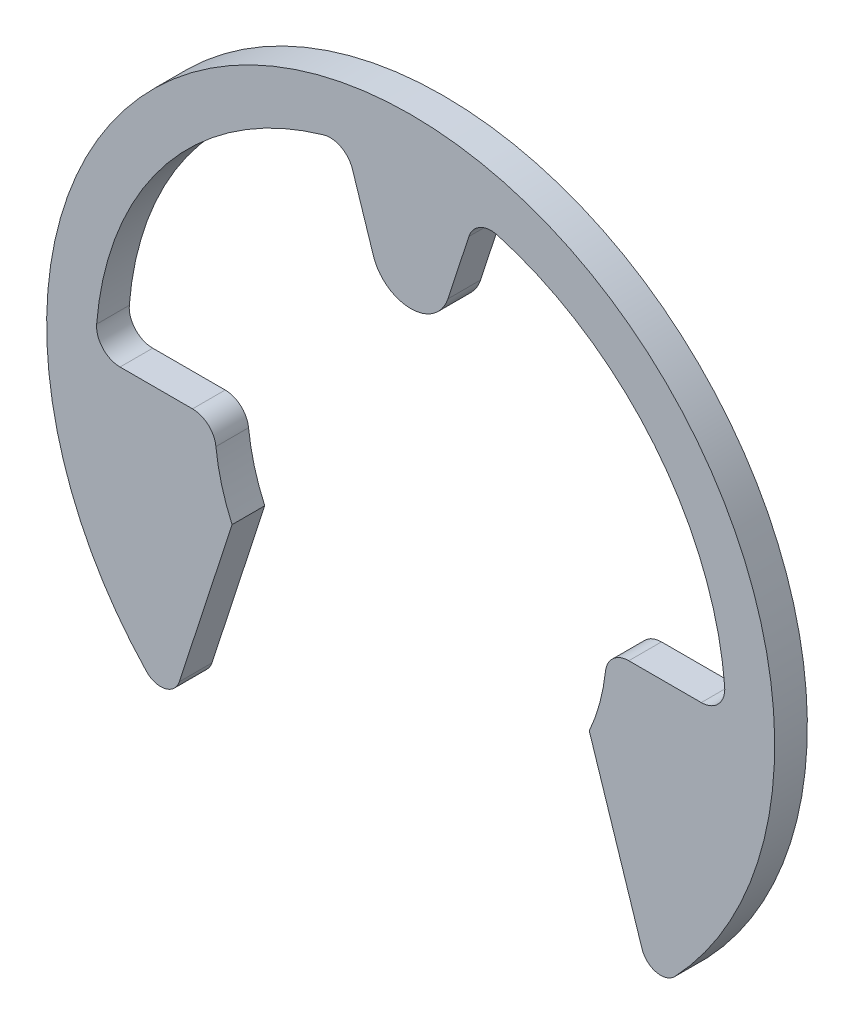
ISO-10303-21;
HEADER;
FILE_DESCRIPTION(('STEP AP214'),'2;1');
FILE_NAME('part.step','',(''),(''),'','','');
FILE_SCHEMA(('AUTOMOTIVE_DESIGN { 1 0 10303 214 1 1 1 1 }'));
ENDSEC;
DATA;
#1=APPLICATION_CONTEXT('core data for automotive mechanical design processes');
#2=APPLICATION_PROTOCOL_DEFINITION('international standard','automotive_design',2000,#1);
#3=PRODUCT_CONTEXT('',#1,'mechanical');
#4=PRODUCT('Part','Part','',(#3));
#5=PRODUCT_RELATED_PRODUCT_CATEGORY('part','',(#4));
#6=PRODUCT_DEFINITION_FORMATION('','',#4);
#7=PRODUCT_DEFINITION_CONTEXT('part definition',#1,'design');
#8=PRODUCT_DEFINITION('design','',#6,#7);
#9=PRODUCT_DEFINITION_SHAPE('','',#8);
#10=(LENGTH_UNIT() NAMED_UNIT(*) SI_UNIT(.MILLI.,.METRE.));
#11=(NAMED_UNIT(*) PLANE_ANGLE_UNIT() SI_UNIT($,.RADIAN.));
#12=(NAMED_UNIT(*) SI_UNIT($,.STERADIAN.) SOLID_ANGLE_UNIT());
#13=UNCERTAINTY_MEASURE_WITH_UNIT(LENGTH_MEASURE(1.E-05),#10,'distance_accuracy_value','');
#14=(GEOMETRIC_REPRESENTATION_CONTEXT(3) GLOBAL_UNCERTAINTY_ASSIGNED_CONTEXT((#13)) GLOBAL_UNIT_ASSIGNED_CONTEXT((#10,
#11,#12)) REPRESENTATION_CONTEXT('',''));
#15=CARTESIAN_POINT('',(0.,0.,0.));
#16=DIRECTION('',(0.,0.,1.));
#17=DIRECTION('',(1.,0.,0.));
#18=AXIS2_PLACEMENT_3D('',#15,#16,#17);
#19=CARTESIAN_POINT('',(-15.3153405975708,-14.513798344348,2.));
#20=DIRECTION('',(0.,0.,-1.));
#21=DIRECTION('',(-1.,0.,0.));
#22=AXIS2_PLACEMENT_3D('',#19,#20,#21);
#23=CYLINDRICAL_SURFACE('',#22,1.2);
#24=CARTESIAN_POINT('',(-15.3153405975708,-14.513798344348,0.));
#25=DIRECTION('',(0.,0.,1.));
#26=DIRECTION('',(-1.,0.,0.));
#27=AXIS2_PLACEMENT_3D('',#24,#25,#26);
#28=CIRCLE('',#27,1.2);
#29=CARTESIAN_POINT('',(-16.1863552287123,-15.339227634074,0.));
#30=VERTEX_POINT('',#29);
#31=CARTESIAN_POINT('',(-14.1740727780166,-14.8846187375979,0.));
#32=VERTEX_POINT('',#31);
#33=EDGE_CURVE('E194',#30,#32,#28,.T.);
#34=ORIENTED_EDGE('',*,*,#33,.T.);
#35=DIRECTION('',(0.,0.,-1.));
#36=VECTOR('',#35,1.);
#37=CARTESIAN_POINT('',(-14.1740727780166,-14.8846187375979,2.));
#38=LINE('',#37,#36);
#39=CARTESIAN_POINT('',(-14.1740727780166,-14.8846187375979,2.));
#40=VERTEX_POINT('',#39);
#41=EDGE_CURVE('E174',#40,#32,#38,.T.);
#42=ORIENTED_EDGE('',*,*,#41,.F.);
#43=CARTESIAN_POINT('',(-15.3153405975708,-14.513798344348,2.));
#44=DIRECTION('',(0.,0.,1.));
#45=DIRECTION('',(-1.,0.,0.));
#46=AXIS2_PLACEMENT_3D('',#43,#44,#45);
#47=CIRCLE('',#46,1.2);
#48=CARTESIAN_POINT('',(-16.1863552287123,-15.339227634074,2.));
#49=VERTEX_POINT('',#48);
#50=EDGE_CURVE('E181',#49,#40,#47,.T.);
#51=ORIENTED_EDGE('',*,*,#50,.F.);
#52=DIRECTION('',(0.,0.,-1.));
#53=VECTOR('',#52,1.);
#54=CARTESIAN_POINT('',(-16.1863552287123,-15.339227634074,2.));
#55=LINE('',#54,#53);
#56=EDGE_CURVE('E296',#49,#30,#55,.T.);
#57=ORIENTED_EDGE('',*,*,#56,.T.);
#58=EDGE_LOOP('',(#34,#42,#51,#57));
#59=FACE_BOUND('',#58,.T.);
#60=ADVANCED_FACE('F32',(#59),#23,.T.);
#61=CARTESIAN_POINT('',(-10.94,-4.9311661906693,2.));
#62=DIRECTION('',(-0.951056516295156,0.309016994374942,0.));
#63=DIRECTION('',(-0.309016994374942,-0.951056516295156,0.));
#64=AXIS2_PLACEMENT_3D('',#61,#62,#63);
#65=PLANE('',#64);
#66=DIRECTION('',(0.309016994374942,0.951056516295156,0.));
#67=VECTOR('',#66,1.);
#68=CARTESIAN_POINT('',(-10.94,-4.9311661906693,0.));
#69=LINE('',#68,#67);
#70=CARTESIAN_POINT('',(-10.94,-4.9311661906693,0.));
#71=VERTEX_POINT('',#70);
#72=EDGE_CURVE('E298',#32,#71,#69,.T.);
#73=ORIENTED_EDGE('',*,*,#72,.T.);
#74=DIRECTION('',(0.,0.,-1.));
#75=VECTOR('',#74,1.);
#76=CARTESIAN_POINT('',(-10.94,-4.9311661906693,2.));
#77=LINE('',#76,#75);
#78=CARTESIAN_POINT('',(-10.94,-4.9311661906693,2.));
#79=VERTEX_POINT('',#78);
#80=EDGE_CURVE('E177',#79,#71,#77,.T.);
#81=ORIENTED_EDGE('',*,*,#80,.F.);
#82=DIRECTION('',(0.309016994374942,0.951056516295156,0.));
#83=VECTOR('',#82,1.);
#84=CARTESIAN_POINT('',(-10.94,-4.9311661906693,2.));
#85=LINE('',#84,#83);
#86=EDGE_CURVE('E170',#40,#79,#85,.T.);
#87=ORIENTED_EDGE('',*,*,#86,.F.);
#88=ORIENTED_EDGE('',*,*,#41,.T.);
#89=EDGE_LOOP('',(#73,#81,#87,#88));
#90=FACE_BOUND('',#89,.T.);
#91=ADVANCED_FACE('F172',(#90),#65,.F.);
#92=CARTESIAN_POINT('',(0.,0.,2.));
#93=DIRECTION('',(0.,0.,-1.));
#94=DIRECTION('',(-1.,0.,0.));
#95=AXIS2_PLACEMENT_3D('',#92,#93,#94);
#96=CYLINDRICAL_SURFACE('',#95,12.);
#97=CARTESIAN_POINT('',(0.,0.,0.));
#98=DIRECTION('',(0.,0.,-1.));
#99=DIRECTION('',(1.,0.,0.));
#100=AXIS2_PLACEMENT_3D('',#97,#98,#99);
#101=CIRCLE('',#100,12.);
#102=CARTESIAN_POINT('',(-11.9309236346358,-1.28571428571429,0.));
#103=VERTEX_POINT('',#102);
#104=EDGE_CURVE('E264',#71,#103,#101,.T.);
#105=ORIENTED_EDGE('',*,*,#104,.T.);
#106=DIRECTION('',(0.,0.,-1.));
#107=VECTOR('',#106,1.);
#108=CARTESIAN_POINT('',(-11.9309236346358,-1.28571428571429,2.));
#109=LINE('',#108,#107);
#110=CARTESIAN_POINT('',(-11.9309236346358,-1.28571428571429,2.));
#111=VERTEX_POINT('',#110);
#112=EDGE_CURVE('E221',#103,#111,#109,.F.);
#113=ORIENTED_EDGE('',*,*,#112,.T.);
#114=CARTESIAN_POINT('',(0.,0.,2.));
#115=DIRECTION('',(0.,0.,-1.));
#116=DIRECTION('',(1.,0.,0.));
#117=AXIS2_PLACEMENT_3D('',#114,#115,#116);
#118=CIRCLE('',#117,12.);
#119=EDGE_CURVE('E180',#79,#111,#118,.T.);
#120=ORIENTED_EDGE('',*,*,#119,.F.);
#121=ORIENTED_EDGE('',*,*,#80,.T.);
#122=EDGE_LOOP('',(#105,#113,#120,#121));
#123=FACE_BOUND('',#122,.T.);
#124=ADVANCED_FACE('F386',(#123),#96,.F.);
#125=CARTESIAN_POINT('',(-12.,0.,2.));
#126=DIRECTION('',(0.,-1.,0.));
#127=DIRECTION('',(0.,0.,-1.));
#128=AXIS2_PLACEMENT_3D('',#125,#126,#127);
#129=PLANE('',#128);
#130=DIRECTION('',(-1.,0.,0.));
#131=VECTOR('',#130,1.);
#132=CARTESIAN_POINT('',(-12.,0.,2.));
#133=LINE('',#132,#131);
#134=CARTESIAN_POINT('',(-13.3626344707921,0.,2.));
#135=VERTEX_POINT('',#134);
#136=CARTESIAN_POINT('',(-17.8018538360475,0.,2.));
#137=VERTEX_POINT('',#136);
#138=EDGE_CURVE('E271',#135,#137,#133,.T.);
#139=ORIENTED_EDGE('',*,*,#138,.F.);
#140=DIRECTION('',(0.,0.,-1.));
#141=VECTOR('',#140,1.);
#142=CARTESIAN_POINT('',(-13.3626344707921,0.,2.));
#143=LINE('',#142,#141);
#144=CARTESIAN_POINT('',(-13.3626344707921,0.,0.));
#145=VERTEX_POINT('',#144);
#146=EDGE_CURVE('E218',#135,#145,#143,.T.);
#147=ORIENTED_EDGE('',*,*,#146,.T.);
#148=DIRECTION('',(-1.,0.,0.));
#149=VECTOR('',#148,1.);
#150=CARTESIAN_POINT('',(-12.,0.,0.));
#151=LINE('',#150,#149);
#152=CARTESIAN_POINT('',(-17.8018538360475,0.,0.));
#153=VERTEX_POINT('',#152);
#154=EDGE_CURVE('E253',#145,#153,#151,.T.);
#155=ORIENTED_EDGE('',*,*,#154,.T.);
#156=DIRECTION('',(0.,0.,1.));
#157=VECTOR('',#156,1.);
#158=CARTESIAN_POINT('',(-17.8018538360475,0.,2.));
#159=LINE('',#158,#157);
#160=EDGE_CURVE('E216',#153,#137,#159,.T.);
#161=ORIENTED_EDGE('',*,*,#160,.T.);
#162=EDGE_LOOP('',(#139,#147,#155,#161));
#163=FACE_BOUND('',#162,.T.);
#164=ADVANCED_FACE('F261',(#163),#129,.F.);
#165=CARTESIAN_POINT('',(0.,0.,2.));
#166=DIRECTION('',(0.,0.,-1.));
#167=DIRECTION('',(-1.,0.,0.));
#168=AXIS2_PLACEMENT_3D('',#165,#166,#167);
#169=CYLINDRICAL_SURFACE('',#168,19.3);
#170=CARTESIAN_POINT('',(0.,0.,0.));
#171=DIRECTION('',(0.,0.,-1.));
#172=DIRECTION('',(1.,0.,0.));
#173=AXIS2_PLACEMENT_3D('',#170,#171,#172);
#174=CIRCLE('',#173,19.3);
#175=CARTESIAN_POINT('',(-19.2371656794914,1.55610302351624,0.));
#176=VERTEX_POINT('',#175);
#177=CARTESIAN_POINT('',(-5.33378987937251,18.5483337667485,0.));
#178=VERTEX_POINT('',#177);
#179=EDGE_CURVE('E255',#176,#178,#174,.T.);
#180=ORIENTED_EDGE('',*,*,#179,.T.);
#181=DIRECTION('',(0.,0.,-1.));
#182=VECTOR('',#181,1.);
#183=CARTESIAN_POINT('',(-5.33378987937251,18.5483337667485,2.));
#184=LINE('',#183,#182);
#185=CARTESIAN_POINT('',(-5.33378987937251,18.5483337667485,2.));
#186=VERTEX_POINT('',#185);
#187=EDGE_CURVE('E235',#178,#186,#184,.F.);
#188=ORIENTED_EDGE('',*,*,#187,.T.);
#189=CARTESIAN_POINT('',(0.,0.,2.));
#190=DIRECTION('',(0.,0.,-1.));
#191=DIRECTION('',(1.,0.,0.));
#192=AXIS2_PLACEMENT_3D('',#189,#190,#191);
#193=CIRCLE('',#192,19.3);
#194=CARTESIAN_POINT('',(-19.2371656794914,1.55610302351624,2.));
#195=VERTEX_POINT('',#194);
#196=EDGE_CURVE('E269',#195,#186,#193,.T.);
#197=ORIENTED_EDGE('',*,*,#196,.F.);
#198=DIRECTION('',(0.,0.,-1.));
#199=VECTOR('',#198,1.);
#200=CARTESIAN_POINT('',(-19.2371656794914,1.55610302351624,2.));
#201=LINE('',#200,#199);
#202=EDGE_CURVE('E232',#195,#176,#201,.T.);
#203=ORIENTED_EDGE('',*,*,#202,.T.);
#204=EDGE_LOOP('',(#180,#188,#197,#203));
#205=FACE_BOUND('',#204,.T.);
#206=ADVANCED_FACE('F273',(#205),#169,.F.);
#207=CARTESIAN_POINT('',(-2.28253563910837,13.6583592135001,2.));
#208=DIRECTION('',(0.951056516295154,0.309016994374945,0.));
#209=DIRECTION('',(-0.309016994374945,0.951056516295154,0.));
#210=AXIS2_PLACEMENT_3D('',#207,#208,#209);
#211=PLANE('',#210);
#212=DIRECTION('',(0.309016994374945,-0.951056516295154,0.));
#213=VECTOR('',#212,1.);
#214=CARTESIAN_POINT('',(-2.28253563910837,13.6583592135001,2.));
#215=LINE('',#214,#213);
#216=CARTESIAN_POINT('',(-3.56630697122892,17.6094011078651,2.));
#217=VERTEX_POINT('',#216);
#218=CARTESIAN_POINT('',(-2.28253563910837,13.6583592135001,2.));
#219=VERTEX_POINT('',#218);
#220=EDGE_CURVE('E275',#217,#219,#215,.T.);
#221=ORIENTED_EDGE('',*,*,#220,.F.);
#222=DIRECTION('',(0.,0.,1.));
#223=VECTOR('',#222,1.);
#224=CARTESIAN_POINT('',(-3.56630697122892,17.6094011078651,0.));
#225=LINE('',#224,#223);
#226=CARTESIAN_POINT('',(-3.56630697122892,17.6094011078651,0.));
#227=VERTEX_POINT('',#226);
#228=EDGE_CURVE('E229',#217,#227,#225,.F.);
#229=ORIENTED_EDGE('',*,*,#228,.T.);
#230=DIRECTION('',(0.309016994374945,-0.951056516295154,0.));
#231=VECTOR('',#230,1.);
#232=CARTESIAN_POINT('',(-2.28253563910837,13.6583592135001,0.));
#233=LINE('',#232,#231);
#234=CARTESIAN_POINT('',(-2.28253563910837,13.6583592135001,0.));
#235=VERTEX_POINT('',#234);
#236=EDGE_CURVE('E303',#227,#235,#233,.T.);
#237=ORIENTED_EDGE('',*,*,#236,.T.);
#238=DIRECTION('',(0.,0.,-1.));
#239=VECTOR('',#238,1.);
#240=CARTESIAN_POINT('',(-2.28253563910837,13.6583592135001,2.));
#241=LINE('',#240,#239);
#242=EDGE_CURVE('E200',#219,#235,#241,.T.);
#243=ORIENTED_EDGE('',*,*,#242,.F.);
#244=EDGE_LOOP('',(#221,#229,#237,#243));
#245=FACE_BOUND('',#244,.T.);
#246=ADVANCED_FACE('F413',(#245),#211,.F.);
#247=CARTESIAN_POINT('',(0.,14.4,2.));
#248=DIRECTION('',(0.,0.,-1.));
#249=DIRECTION('',(-1.,0.,0.));
#250=AXIS2_PLACEMENT_3D('',#247,#248,#249);
#251=CYLINDRICAL_SURFACE('',#250,2.4);
#252=CARTESIAN_POINT('',(0.,14.4,0.));
#253=DIRECTION('',(0.,0.,1.));
#254=DIRECTION('',(1.,0.,0.));
#255=AXIS2_PLACEMENT_3D('',#252,#253,#254);
#256=CIRCLE('',#255,2.4);
#257=CARTESIAN_POINT('',(2.28253563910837,13.6583592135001,0.));
#258=VERTEX_POINT('',#257);
#259=EDGE_CURVE('E305',#235,#258,#256,.T.);
#260=ORIENTED_EDGE('',*,*,#259,.T.);
#261=DIRECTION('',(0.,0.,-1.));
#262=VECTOR('',#261,1.);
#263=CARTESIAN_POINT('',(2.28253563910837,13.6583592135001,2.));
#264=LINE('',#263,#262);
#265=CARTESIAN_POINT('',(2.28253563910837,13.6583592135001,2.));
#266=VERTEX_POINT('',#265);
#267=EDGE_CURVE('E332',#266,#258,#264,.T.);
#268=ORIENTED_EDGE('',*,*,#267,.F.);
#269=CARTESIAN_POINT('',(0.,14.4,2.));
#270=DIRECTION('',(0.,0.,1.));
#271=DIRECTION('',(1.,0.,0.));
#272=AXIS2_PLACEMENT_3D('',#269,#270,#271);
#273=CIRCLE('',#272,2.4);
#274=EDGE_CURVE('E277',#219,#266,#273,.T.);
#275=ORIENTED_EDGE('',*,*,#274,.F.);
#276=ORIENTED_EDGE('',*,*,#242,.T.);
#277=EDGE_LOOP('',(#260,#268,#275,#276));
#278=FACE_BOUND('',#277,.T.);
#279=ADVANCED_FACE('F339',(#278),#251,.T.);
#280=CARTESIAN_POINT('',(2.28253563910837,13.6583592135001,2.));
#281=DIRECTION('',(-0.951056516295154,0.309016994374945,0.));
#282=DIRECTION('',(-0.309016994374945,-0.951056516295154,0.));
#283=AXIS2_PLACEMENT_3D('',#280,#281,#282);
#284=PLANE('',#283);
#285=DIRECTION('',(0.309016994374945,0.951056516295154,0.));
#286=VECTOR('',#285,1.);
#287=CARTESIAN_POINT('',(2.28253563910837,13.6583592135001,0.));
#288=LINE('',#287,#286);
#289=CARTESIAN_POINT('',(3.56630697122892,17.6094011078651,0.));
#290=VERTEX_POINT('',#289);
#291=EDGE_CURVE('E307',#258,#290,#288,.T.);
#292=ORIENTED_EDGE('',*,*,#291,.T.);
#293=DIRECTION('',(0.,0.,1.));
#294=VECTOR('',#293,1.);
#295=CARTESIAN_POINT('',(3.56630697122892,17.6094011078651,2.));
#296=LINE('',#295,#294);
#297=CARTESIAN_POINT('',(3.56630697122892,17.6094011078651,2.));
#298=VERTEX_POINT('',#297);
#299=EDGE_CURVE('E227',#290,#298,#296,.T.);
#300=ORIENTED_EDGE('',*,*,#299,.T.);
#301=DIRECTION('',(0.309016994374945,0.951056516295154,0.));
#302=VECTOR('',#301,1.);
#303=CARTESIAN_POINT('',(2.28253563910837,13.6583592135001,2.));
#304=LINE('',#303,#302);
#305=EDGE_CURVE('E283',#266,#298,#304,.T.);
#306=ORIENTED_EDGE('',*,*,#305,.F.);
#307=ORIENTED_EDGE('',*,*,#267,.T.);
#308=EDGE_LOOP('',(#292,#300,#306,#307));
#309=FACE_BOUND('',#308,.T.);
#310=ADVANCED_FACE('F348',(#309),#284,.F.);
#311=CARTESIAN_POINT('',(0.,0.,2.));
#312=DIRECTION('',(0.,0.,-1.));
#313=DIRECTION('',(-1.,0.,0.));
#314=AXIS2_PLACEMENT_3D('',#311,#312,#313);
#315=CYLINDRICAL_SURFACE('',#314,19.3);
#316=CARTESIAN_POINT('',(0.,0.,2.));
#317=DIRECTION('',(0.,0.,-1.));
#318=DIRECTION('',(1.,0.,0.));
#319=AXIS2_PLACEMENT_3D('',#316,#317,#318);
#320=CIRCLE('',#319,19.3);
#321=CARTESIAN_POINT('',(5.33378987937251,18.5483337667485,2.));
#322=VERTEX_POINT('',#321);
#323=CARTESIAN_POINT('',(19.2371656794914,1.55610302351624,2.));
#324=VERTEX_POINT('',#323);
#325=EDGE_CURVE('E285',#322,#324,#320,.T.);
#326=ORIENTED_EDGE('',*,*,#325,.F.);
#327=DIRECTION('',(0.,0.,-1.));
#328=VECTOR('',#327,1.);
#329=CARTESIAN_POINT('',(5.33378987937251,18.5483337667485,2.));
#330=LINE('',#329,#328);
#331=CARTESIAN_POINT('',(5.33378987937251,18.5483337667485,0.));
#332=VERTEX_POINT('',#331);
#333=EDGE_CURVE('E224',#322,#332,#330,.T.);
#334=ORIENTED_EDGE('',*,*,#333,.T.);
#335=CARTESIAN_POINT('',(0.,0.,0.));
#336=DIRECTION('',(0.,0.,-1.));
#337=DIRECTION('',(1.,0.,0.));
#338=AXIS2_PLACEMENT_3D('',#335,#336,#337);
#339=CIRCLE('',#338,19.3);
#340=CARTESIAN_POINT('',(19.2371656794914,1.55610302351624,0.));
#341=VERTEX_POINT('',#340);
#342=EDGE_CURVE('E310',#332,#341,#339,.T.);
#343=ORIENTED_EDGE('',*,*,#342,.T.);
#344=DIRECTION('',(0.,0.,-1.));
#345=VECTOR('',#344,1.);
#346=CARTESIAN_POINT('',(19.2371656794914,1.55610302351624,2.));
#347=LINE('',#346,#345);
#348=EDGE_CURVE('E47',#341,#324,#347,.F.);
#349=ORIENTED_EDGE('',*,*,#348,.T.);
#350=EDGE_LOOP('',(#326,#334,#343,#349));
#351=FACE_BOUND('',#350,.T.);
#352=ADVANCED_FACE('F353',(#351),#315,.F.);
#353=CARTESIAN_POINT('',(12.,0.,2.));
#354=DIRECTION('',(0.,-1.,0.));
#355=DIRECTION('',(0.,0.,-1.));
#356=AXIS2_PLACEMENT_3D('',#353,#354,#355);
#357=PLANE('',#356);
#358=DIRECTION('',(-1.,0.,0.));
#359=VECTOR('',#358,1.);
#360=CARTESIAN_POINT('',(12.,0.,0.));
#361=LINE('',#360,#359);
#362=CARTESIAN_POINT('',(17.8018538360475,0.,0.));
#363=VERTEX_POINT('',#362);
#364=CARTESIAN_POINT('',(13.3626344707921,0.,0.));
#365=VERTEX_POINT('',#364);
#366=EDGE_CURVE('E312',#363,#365,#361,.T.);
#367=ORIENTED_EDGE('',*,*,#366,.T.);
#368=DIRECTION('',(0.,0.,-1.));
#369=VECTOR('',#368,1.);
#370=CARTESIAN_POINT('',(13.3626344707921,0.,2.));
#371=LINE('',#370,#369);
#372=CARTESIAN_POINT('',(13.3626344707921,0.,2.));
#373=VERTEX_POINT('',#372);
#374=EDGE_CURVE('E210',#365,#373,#371,.F.);
#375=ORIENTED_EDGE('',*,*,#374,.T.);
#376=DIRECTION('',(-1.,0.,0.));
#377=VECTOR('',#376,1.);
#378=CARTESIAN_POINT('',(12.,0.,2.));
#379=LINE('',#378,#377);
#380=CARTESIAN_POINT('',(17.8018538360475,0.,2.));
#381=VERTEX_POINT('',#380);
#382=EDGE_CURVE('E287',#381,#373,#379,.T.);
#383=ORIENTED_EDGE('',*,*,#382,.F.);
#384=DIRECTION('',(0.,0.,1.));
#385=VECTOR('',#384,1.);
#386=CARTESIAN_POINT('',(17.8018538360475,0.,0.));
#387=LINE('',#386,#385);
#388=EDGE_CURVE('E207',#381,#363,#387,.F.);
#389=ORIENTED_EDGE('',*,*,#388,.T.);
#390=EDGE_LOOP('',(#367,#375,#383,#389));
#391=FACE_BOUND('',#390,.T.);
#392=ADVANCED_FACE('F361',(#391),#357,.F.);
#393=CARTESIAN_POINT('',(0.,0.,2.));
#394=DIRECTION('',(0.,0.,-1.));
#395=DIRECTION('',(-1.,0.,0.));
#396=AXIS2_PLACEMENT_3D('',#393,#394,#395);
#397=CYLINDRICAL_SURFACE('',#396,12.);
#398=CARTESIAN_POINT('',(0.,0.,2.));
#399=DIRECTION('',(0.,0.,-1.));
#400=DIRECTION('',(1.,0.,0.));
#401=AXIS2_PLACEMENT_3D('',#398,#399,#400);
#402=CIRCLE('',#401,12.);
#403=CARTESIAN_POINT('',(11.9309236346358,-1.28571428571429,2.));
#404=VERTEX_POINT('',#403);
#405=CARTESIAN_POINT('',(10.94,-4.9311661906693,2.));
#406=VERTEX_POINT('',#405);
#407=EDGE_CURVE('E289',#404,#406,#402,.T.);
#408=ORIENTED_EDGE('',*,*,#407,.F.);
#409=DIRECTION('',(0.,0.,-1.));
#410=VECTOR('',#409,1.);
#411=CARTESIAN_POINT('',(11.9309236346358,-1.28571428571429,2.));
#412=LINE('',#411,#410);
#413=CARTESIAN_POINT('',(11.9309236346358,-1.28571428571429,0.));
#414=VERTEX_POINT('',#413);
#415=EDGE_CURVE('E195',#404,#414,#412,.T.);
#416=ORIENTED_EDGE('',*,*,#415,.T.);
#417=CARTESIAN_POINT('',(0.,0.,0.));
#418=DIRECTION('',(0.,0.,-1.));
#419=DIRECTION('',(1.,0.,0.));
#420=AXIS2_PLACEMENT_3D('',#417,#418,#419);
#421=CIRCLE('',#420,12.);
#422=CARTESIAN_POINT('',(10.94,-4.9311661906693,0.));
#423=VERTEX_POINT('',#422);
#424=EDGE_CURVE('E315',#414,#423,#421,.T.);
#425=ORIENTED_EDGE('',*,*,#424,.T.);
#426=DIRECTION('',(0.,0.,-1.));
#427=VECTOR('',#426,1.);
#428=CARTESIAN_POINT('',(10.94,-4.9311661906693,2.));
#429=LINE('',#428,#427);
#430=EDGE_CURVE('E329',#406,#423,#429,.T.);
#431=ORIENTED_EDGE('',*,*,#430,.F.);
#432=EDGE_LOOP('',(#408,#416,#425,#431));
#433=FACE_BOUND('',#432,.T.);
#434=ADVANCED_FACE('F369',(#433),#397,.F.);
#435=CARTESIAN_POINT('',(10.94,-4.9311661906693,2.));
#436=DIRECTION('',(0.951056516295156,0.309016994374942,0.));
#437=DIRECTION('',(-0.309016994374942,0.951056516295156,0.));
#438=AXIS2_PLACEMENT_3D('',#435,#436,#437);
#439=PLANE('',#438);
#440=DIRECTION('',(0.309016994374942,-0.951056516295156,0.));
#441=VECTOR('',#440,1.);
#442=CARTESIAN_POINT('',(10.94,-4.9311661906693,0.));
#443=LINE('',#442,#441);
#444=CARTESIAN_POINT('',(14.1740727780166,-14.8846187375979,0.));
#445=VERTEX_POINT('',#444);
#446=EDGE_CURVE('E317',#423,#445,#443,.T.);
#447=ORIENTED_EDGE('',*,*,#446,.T.);
#448=DIRECTION('',(0.,0.,-1.));
#449=VECTOR('',#448,1.);
#450=CARTESIAN_POINT('',(14.1740727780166,-14.8846187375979,2.));
#451=LINE('',#450,#449);
#452=CARTESIAN_POINT('',(14.1740727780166,-14.8846187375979,2.));
#453=VERTEX_POINT('',#452);
#454=EDGE_CURVE('E326',#453,#445,#451,.T.);
#455=ORIENTED_EDGE('',*,*,#454,.F.);
#456=DIRECTION('',(0.309016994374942,-0.951056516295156,0.));
#457=VECTOR('',#456,1.);
#458=CARTESIAN_POINT('',(10.94,-4.9311661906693,2.));
#459=LINE('',#458,#457);
#460=EDGE_CURVE('E291',#406,#453,#459,.T.);
#461=ORIENTED_EDGE('',*,*,#460,.F.);
#462=ORIENTED_EDGE('',*,*,#430,.T.);
#463=EDGE_LOOP('',(#447,#455,#461,#462));
#464=FACE_BOUND('',#463,.T.);
#465=ADVANCED_FACE('F376',(#464),#439,.F.);
#466=CARTESIAN_POINT('',(15.3153405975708,-14.513798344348,2.));
#467=DIRECTION('',(0.,0.,-1.));
#468=DIRECTION('',(-1.,0.,0.));
#469=AXIS2_PLACEMENT_3D('',#466,#467,#468);
#470=CYLINDRICAL_SURFACE('',#469,1.2);
#471=CARTESIAN_POINT('',(15.3153405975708,-14.513798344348,0.));
#472=DIRECTION('',(0.,0.,1.));
#473=DIRECTION('',(-1.,0.,0.));
#474=AXIS2_PLACEMENT_3D('',#471,#472,#473);
#475=CIRCLE('',#474,1.2);
#476=CARTESIAN_POINT('',(16.1863552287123,-15.339227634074,0.));
#477=VERTEX_POINT('',#476);
#478=EDGE_CURVE('E319',#445,#477,#475,.T.);
#479=ORIENTED_EDGE('',*,*,#478,.T.);
#480=DIRECTION('',(0.,0.,-1.));
#481=VECTOR('',#480,1.);
#482=CARTESIAN_POINT('',(16.1863552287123,-15.339227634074,2.));
#483=LINE('',#482,#481);
#484=CARTESIAN_POINT('',(16.1863552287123,-15.339227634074,2.));
#485=VERTEX_POINT('',#484);
#486=EDGE_CURVE('E323',#485,#477,#483,.T.);
#487=ORIENTED_EDGE('',*,*,#486,.F.);
#488=CARTESIAN_POINT('',(15.3153405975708,-14.513798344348,2.));
#489=DIRECTION('',(0.,0.,1.));
#490=DIRECTION('',(-1.,0.,0.));
#491=AXIS2_PLACEMENT_3D('',#488,#489,#490);
#492=CIRCLE('',#491,1.2);
#493=EDGE_CURVE('E293',#453,#485,#492,.T.);
#494=ORIENTED_EDGE('',*,*,#493,.F.);
#495=ORIENTED_EDGE('',*,*,#454,.T.);
#496=EDGE_LOOP('',(#479,#487,#494,#495));
#497=FACE_BOUND('',#496,.T.);
#498=ADVANCED_FACE('F380',(#497),#470,.T.);
#499=CARTESIAN_POINT('',(0.,0.,2.));
#500=DIRECTION('',(0.,0.,-1.));
#501=DIRECTION('',(-1.,0.,0.));
#502=AXIS2_PLACEMENT_3D('',#499,#500,#501);
#503=CYLINDRICAL_SURFACE('',#502,22.3);
#504=CARTESIAN_POINT('',(0.,0.,0.));
#505=DIRECTION('',(0.,0.,1.));
#506=DIRECTION('',(1.,0.,0.));
#507=AXIS2_PLACEMENT_3D('',#504,#505,#506);
#508=CIRCLE('',#507,22.3);
#509=EDGE_CURVE('E191',#477,#30,#508,.T.);
#510=ORIENTED_EDGE('',*,*,#509,.T.);
#511=ORIENTED_EDGE('',*,*,#56,.F.);
#512=CARTESIAN_POINT('',(0.,0.,2.));
#513=DIRECTION('',(0.,0.,1.));
#514=DIRECTION('',(1.,0.,0.));
#515=AXIS2_PLACEMENT_3D('',#512,#513,#514);
#516=CIRCLE('',#515,22.3);
#517=EDGE_CURVE('E187',#485,#49,#516,.T.);
#518=ORIENTED_EDGE('',*,*,#517,.F.);
#519=ORIENTED_EDGE('',*,*,#486,.T.);
#520=EDGE_LOOP('',(#510,#511,#518,#519));
#521=FACE_BOUND('',#520,.T.);
#522=ADVANCED_FACE('F383',(#521),#503,.T.);
#523=CARTESIAN_POINT('',(-15.3153405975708,-14.513798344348,2.));
#524=DIRECTION('',(0.,0.,-1.));
#525=DIRECTION('',(-1.,0.,0.));
#526=AXIS2_PLACEMENT_3D('',#523,#524,#525);
#527=PLANE('',#526);
#528=ORIENTED_EDGE('',*,*,#382,.T.);
#529=CARTESIAN_POINT('',(13.3626344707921,-1.44,2.));
#530=DIRECTION('',(0.,0.,-1.));
#531=DIRECTION('',(-1.,0.,0.));
#532=AXIS2_PLACEMENT_3D('',#529,#530,#531);
#533=CIRCLE('',#532,1.44);
#534=EDGE_CURVE('E214',#373,#404,#533,.F.);
#535=ORIENTED_EDGE('',*,*,#534,.T.);
#536=ORIENTED_EDGE('',*,*,#407,.T.);
#537=ORIENTED_EDGE('',*,*,#460,.T.);
#538=ORIENTED_EDGE('',*,*,#493,.T.);
#539=ORIENTED_EDGE('',*,*,#517,.T.);
#540=ORIENTED_EDGE('',*,*,#50,.T.);
#541=ORIENTED_EDGE('',*,*,#86,.T.);
#542=ORIENTED_EDGE('',*,*,#119,.T.);
#543=CARTESIAN_POINT('',(-13.3626344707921,-1.44,2.));
#544=DIRECTION('',(0.,0.,-1.));
#545=DIRECTION('',(-1.,0.,0.));
#546=AXIS2_PLACEMENT_3D('',#543,#544,#545);
#547=CIRCLE('',#546,1.44);
#548=EDGE_CURVE('E212',#111,#135,#547,.F.);
#549=ORIENTED_EDGE('',*,*,#548,.T.);
#550=ORIENTED_EDGE('',*,*,#138,.T.);
#551=CARTESIAN_POINT('',(-17.8018538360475,1.44,2.));
#552=DIRECTION('',(0.,0.,-1.));
#553=DIRECTION('',(-1.,0.,0.));
#554=AXIS2_PLACEMENT_3D('',#551,#552,#553);
#555=CIRCLE('',#554,1.44);
#556=EDGE_CURVE('E11',#137,#195,#555,.T.);
#557=ORIENTED_EDGE('',*,*,#556,.T.);
#558=ORIENTED_EDGE('',*,*,#196,.T.);
#559=CARTESIAN_POINT('',(-4.93582835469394,17.1644166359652,2.));
#560=DIRECTION('',(0.,0.,-1.));
#561=DIRECTION('',(-1.,0.,0.));
#562=AXIS2_PLACEMENT_3D('',#559,#560,#561);
#563=CIRCLE('',#562,1.44);
#564=EDGE_CURVE('E242',#186,#217,#563,.T.);
#565=ORIENTED_EDGE('',*,*,#564,.T.);
#566=ORIENTED_EDGE('',*,*,#220,.T.);
#567=ORIENTED_EDGE('',*,*,#274,.T.);
#568=ORIENTED_EDGE('',*,*,#305,.T.);
#569=CARTESIAN_POINT('',(4.93582835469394,17.1644166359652,2.));
#570=DIRECTION('',(0.,0.,-1.));
#571=DIRECTION('',(-1.,0.,0.));
#572=AXIS2_PLACEMENT_3D('',#569,#570,#571);
#573=CIRCLE('',#572,1.44);
#574=EDGE_CURVE('E54',#298,#322,#573,.T.);
#575=ORIENTED_EDGE('',*,*,#574,.T.);
#576=ORIENTED_EDGE('',*,*,#325,.T.);
#577=CARTESIAN_POINT('',(17.8018538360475,1.44,2.));
#578=DIRECTION('',(0.,0.,-1.));
#579=DIRECTION('',(-1.,0.,0.));
#580=AXIS2_PLACEMENT_3D('',#577,#578,#579);
#581=CIRCLE('',#580,1.44);
#582=EDGE_CURVE('E246',#324,#381,#581,.T.);
#583=ORIENTED_EDGE('',*,*,#582,.T.);
#584=EDGE_LOOP('',(#528,#535,#536,#537,#538,#539,#540,#541,#542,#549,#550,#557,#558,#565,#566,
#567,#568,#575,#576,#583));
#585=FACE_BOUND('',#584,.T.);
#586=ADVANCED_FACE('F185',(#585),#527,.F.);
#587=CARTESIAN_POINT('',(-15.3153405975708,-14.513798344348,0.));
#588=DIRECTION('',(0.,0.,-1.));
#589=DIRECTION('',(-1.,0.,0.));
#590=AXIS2_PLACEMENT_3D('',#587,#588,#589);
#591=PLANE('',#590);
#592=ORIENTED_EDGE('',*,*,#424,.F.);
#593=CARTESIAN_POINT('',(13.3626344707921,-1.44,0.));
#594=DIRECTION('',(0.,0.,-1.));
#595=DIRECTION('',(-1.,0.,0.));
#596=AXIS2_PLACEMENT_3D('',#593,#594,#595);
#597=CIRCLE('',#596,1.44);
#598=EDGE_CURVE('E205',#414,#365,#597,.T.);
#599=ORIENTED_EDGE('',*,*,#598,.T.);
#600=ORIENTED_EDGE('',*,*,#366,.F.);
#601=CARTESIAN_POINT('',(17.8018538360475,1.44,0.));
#602=DIRECTION('',(0.,0.,-1.));
#603=DIRECTION('',(-1.,0.,0.));
#604=AXIS2_PLACEMENT_3D('',#601,#602,#603);
#605=CIRCLE('',#604,1.44);
#606=EDGE_CURVE('E244',#363,#341,#605,.F.);
#607=ORIENTED_EDGE('',*,*,#606,.T.);
#608=ORIENTED_EDGE('',*,*,#342,.F.);
#609=CARTESIAN_POINT('',(4.93582835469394,17.1644166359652,0.));
#610=DIRECTION('',(0.,0.,-1.));
#611=DIRECTION('',(-1.,0.,0.));
#612=AXIS2_PLACEMENT_3D('',#609,#610,#611);
#613=CIRCLE('',#612,1.44);
#614=EDGE_CURVE('E237',#332,#290,#613,.F.);
#615=ORIENTED_EDGE('',*,*,#614,.T.);
#616=ORIENTED_EDGE('',*,*,#291,.F.);
#617=ORIENTED_EDGE('',*,*,#259,.F.);
#618=ORIENTED_EDGE('',*,*,#236,.F.);
#619=CARTESIAN_POINT('',(-4.93582835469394,17.1644166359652,0.));
#620=DIRECTION('',(0.,0.,-1.));
#621=DIRECTION('',(-1.,0.,0.));
#622=AXIS2_PLACEMENT_3D('',#619,#620,#621);
#623=CIRCLE('',#622,1.44);
#624=EDGE_CURVE('E240',#227,#178,#623,.F.);
#625=ORIENTED_EDGE('',*,*,#624,.T.);
#626=ORIENTED_EDGE('',*,*,#179,.F.);
#627=CARTESIAN_POINT('',(-17.8018538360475,1.44,0.));
#628=DIRECTION('',(0.,0.,-1.));
#629=DIRECTION('',(-1.,0.,0.));
#630=AXIS2_PLACEMENT_3D('',#627,#628,#629);
#631=CIRCLE('',#630,1.44);
#632=EDGE_CURVE('E40',#176,#153,#631,.F.);
#633=ORIENTED_EDGE('',*,*,#632,.T.);
#634=ORIENTED_EDGE('',*,*,#154,.F.);
#635=CARTESIAN_POINT('',(-13.3626344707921,-1.44,0.));
#636=DIRECTION('',(0.,0.,-1.));
#637=DIRECTION('',(-1.,0.,0.));
#638=AXIS2_PLACEMENT_3D('',#635,#636,#637);
#639=CIRCLE('',#638,1.44);
#640=EDGE_CURVE('E198',#145,#103,#639,.T.);
#641=ORIENTED_EDGE('',*,*,#640,.T.);
#642=ORIENTED_EDGE('',*,*,#104,.F.);
#643=ORIENTED_EDGE('',*,*,#72,.F.);
#644=ORIENTED_EDGE('',*,*,#33,.F.);
#645=ORIENTED_EDGE('',*,*,#509,.F.);
#646=ORIENTED_EDGE('',*,*,#478,.F.);
#647=ORIENTED_EDGE('',*,*,#446,.F.);
#648=EDGE_LOOP('',(#592,#599,#600,#607,#608,#615,#616,#617,#618,#625,#626,#633,#634,#641,#642,
#643,#644,#645,#646,#647));
#649=FACE_BOUND('',#648,.T.);
#650=ADVANCED_FACE('F252',(#649),#591,.T.);
#651=CARTESIAN_POINT('',(13.3626344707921,-1.44,2.));
#652=DIRECTION('',(0.,0.,-1.));
#653=DIRECTION('',(-1.,0.,0.));
#654=AXIS2_PLACEMENT_3D('',#651,#652,#653);
#655=CYLINDRICAL_SURFACE('',#654,1.44);
#656=ORIENTED_EDGE('',*,*,#534,.F.);
#657=ORIENTED_EDGE('',*,*,#374,.F.);
#658=ORIENTED_EDGE('',*,*,#598,.F.);
#659=ORIENTED_EDGE('',*,*,#415,.F.);
#660=EDGE_LOOP('',(#656,#657,#658,#659));
#661=FACE_BOUND('',#660,.T.);
#662=ADVANCED_FACE('F367',(#661),#655,.T.);
#663=CARTESIAN_POINT('',(-13.3626344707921,-1.44,2.));
#664=DIRECTION('',(0.,0.,-1.));
#665=DIRECTION('',(-1.,0.,0.));
#666=AXIS2_PLACEMENT_3D('',#663,#664,#665);
#667=CYLINDRICAL_SURFACE('',#666,1.44);
#668=ORIENTED_EDGE('',*,*,#548,.F.);
#669=ORIENTED_EDGE('',*,*,#112,.F.);
#670=ORIENTED_EDGE('',*,*,#640,.F.);
#671=ORIENTED_EDGE('',*,*,#146,.F.);
#672=EDGE_LOOP('',(#668,#669,#670,#671));
#673=FACE_BOUND('',#672,.T.);
#674=ADVANCED_FACE('F390',(#673),#667,.T.);
#675=CARTESIAN_POINT('',(4.93582835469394,17.1644166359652,2.));
#676=DIRECTION('',(0.,0.,-1.));
#677=DIRECTION('',(-1.,0.,0.));
#678=AXIS2_PLACEMENT_3D('',#675,#676,#677);
#679=CYLINDRICAL_SURFACE('',#678,1.44);
#680=ORIENTED_EDGE('',*,*,#574,.F.);
#681=ORIENTED_EDGE('',*,*,#299,.F.);
#682=ORIENTED_EDGE('',*,*,#614,.F.);
#683=ORIENTED_EDGE('',*,*,#333,.F.);
#684=EDGE_LOOP('',(#680,#681,#682,#683));
#685=FACE_BOUND('',#684,.T.);
#686=ADVANCED_FACE('F351',(#685),#679,.F.);
#687=CARTESIAN_POINT('',(-4.93582835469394,17.1644166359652,2.));
#688=DIRECTION('',(0.,0.,-1.));
#689=DIRECTION('',(-1.,0.,0.));
#690=AXIS2_PLACEMENT_3D('',#687,#688,#689);
#691=CYLINDRICAL_SURFACE('',#690,1.44);
#692=ORIENTED_EDGE('',*,*,#564,.F.);
#693=ORIENTED_EDGE('',*,*,#187,.F.);
#694=ORIENTED_EDGE('',*,*,#624,.F.);
#695=ORIENTED_EDGE('',*,*,#228,.F.);
#696=EDGE_LOOP('',(#692,#693,#694,#695));
#697=FACE_BOUND('',#696,.T.);
#698=ADVANCED_FACE('F397',(#697),#691,.F.);
#699=CARTESIAN_POINT('',(17.8018538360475,1.44,2.));
#700=DIRECTION('',(0.,0.,-1.));
#701=DIRECTION('',(-1.,0.,0.));
#702=AXIS2_PLACEMENT_3D('',#699,#700,#701);
#703=CYLINDRICAL_SURFACE('',#702,1.44);
#704=ORIENTED_EDGE('',*,*,#582,.F.);
#705=ORIENTED_EDGE('',*,*,#348,.F.);
#706=ORIENTED_EDGE('',*,*,#606,.F.);
#707=ORIENTED_EDGE('',*,*,#388,.F.);
#708=EDGE_LOOP('',(#704,#705,#706,#707));
#709=FACE_BOUND('',#708,.T.);
#710=ADVANCED_FACE('F358',(#709),#703,.F.);
#711=CARTESIAN_POINT('',(-17.8018538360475,1.44,2.));
#712=DIRECTION('',(0.,0.,-1.));
#713=DIRECTION('',(-1.,0.,0.));
#714=AXIS2_PLACEMENT_3D('',#711,#712,#713);
#715=CYLINDRICAL_SURFACE('',#714,1.44);
#716=ORIENTED_EDGE('',*,*,#556,.F.);
#717=ORIENTED_EDGE('',*,*,#160,.F.);
#718=ORIENTED_EDGE('',*,*,#632,.F.);
#719=ORIENTED_EDGE('',*,*,#202,.F.);
#720=EDGE_LOOP('',(#716,#717,#718,#719));
#721=FACE_BOUND('',#720,.T.);
#722=ADVANCED_FACE('F34',(#721),#715,.F.);
#723=CLOSED_SHELL('',(#60,#91,#124,#164,#206,#246,#279,#310,#352,#392,#434,#465,#498,#522,#586,
#650,#662,#674,#686,#698,#710,#722));
#724=MANIFOLD_SOLID_BREP('B2',#723);
#725=ADVANCED_BREP_SHAPE_REPRESENTATION('',(#18,#724),#14);
#726=SHAPE_DEFINITION_REPRESENTATION(#9,#725);
ENDSEC;
END-ISO-10303-21;
